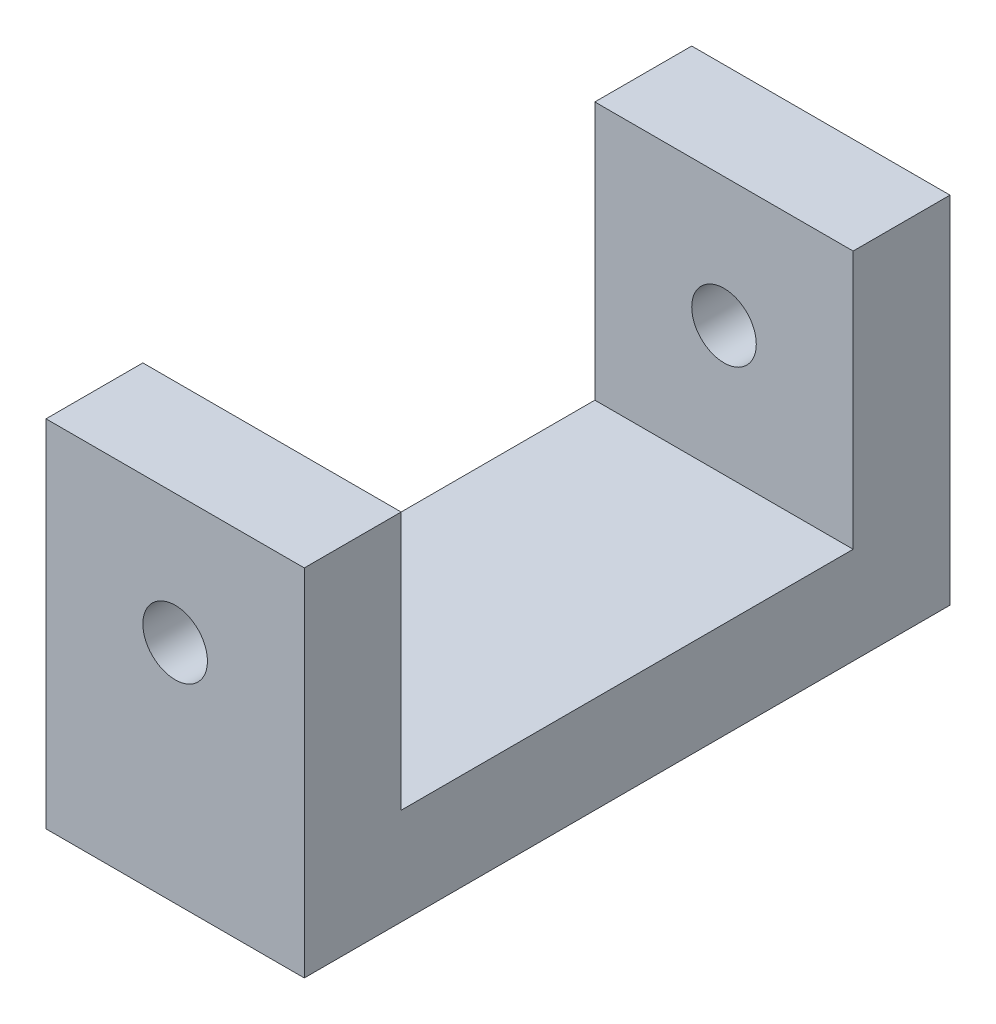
ISO-10303-21;
HEADER;
FILE_DESCRIPTION(('STEP AP214'),'2;1');
FILE_NAME('part.step','',(''),(''),'','','');
FILE_SCHEMA(('AUTOMOTIVE_DESIGN { 1 0 10303 214 1 1 1 1 }'));
ENDSEC;
DATA;
#1=APPLICATION_CONTEXT('core data for automotive mechanical design processes');
#2=APPLICATION_PROTOCOL_DEFINITION('international standard','automotive_design',2000,#1);
#3=PRODUCT_CONTEXT('',#1,'mechanical');
#4=PRODUCT('Part','Part','',(#3));
#5=PRODUCT_RELATED_PRODUCT_CATEGORY('part','',(#4));
#6=PRODUCT_DEFINITION_FORMATION('','',#4);
#7=PRODUCT_DEFINITION_CONTEXT('part definition',#1,'design');
#8=PRODUCT_DEFINITION('design','',#6,#7);
#9=PRODUCT_DEFINITION_SHAPE('','',#8);
#10=(LENGTH_UNIT() NAMED_UNIT(*) SI_UNIT(.MILLI.,.METRE.));
#11=(NAMED_UNIT(*) PLANE_ANGLE_UNIT() SI_UNIT($,.RADIAN.));
#12=(NAMED_UNIT(*) SI_UNIT($,.STERADIAN.) SOLID_ANGLE_UNIT());
#13=UNCERTAINTY_MEASURE_WITH_UNIT(LENGTH_MEASURE(1.E-05),#10,'distance_accuracy_value','');
#14=(GEOMETRIC_REPRESENTATION_CONTEXT(3) GLOBAL_UNCERTAINTY_ASSIGNED_CONTEXT((#13)) GLOBAL_UNIT_ASSIGNED_CONTEXT((#10,
#11,#12)) REPRESENTATION_CONTEXT('',''));
#15=CARTESIAN_POINT('',(0.,0.,0.));
#16=DIRECTION('',(0.,0.,1.));
#17=DIRECTION('',(1.,0.,0.));
#18=AXIS2_PLACEMENT_3D('',#15,#16,#17);
#19=CARTESIAN_POINT('',(0.,0.,-100.));
#20=DIRECTION('',(-1.,0.,0.));
#21=DIRECTION('',(0.,0.,1.));
#22=AXIS2_PLACEMENT_3D('',#19,#20,#21);
#23=PLANE('',#22);
#24=DIRECTION('',(0.,0.,1.));
#25=VECTOR('',#24,1.);
#26=CARTESIAN_POINT('',(0.,15.,-85.));
#27=LINE('',#26,#25);
#28=CARTESIAN_POINT('',(0.,15.,-85.));
#29=VERTEX_POINT('',#28);
#30=CARTESIAN_POINT('',(0.,15.,-15.));
#31=VERTEX_POINT('',#30);
#32=EDGE_CURVE('E102',#29,#31,#27,.T.);
#33=ORIENTED_EDGE('',*,*,#32,.F.);
#34=DIRECTION('',(0.,1.,0.));
#35=VECTOR('',#34,1.);
#36=CARTESIAN_POINT('',(0.,15.,-85.));
#37=LINE('',#36,#35);
#38=CARTESIAN_POINT('',(0.,55.,-85.));
#39=VERTEX_POINT('',#38);
#40=EDGE_CURVE('E50',#29,#39,#37,.T.);
#41=ORIENTED_EDGE('',*,*,#40,.T.);
#42=DIRECTION('',(0.,0.,1.));
#43=VECTOR('',#42,1.);
#44=CARTESIAN_POINT('',(0.,55.,-100.));
#45=LINE('',#44,#43);
#46=CARTESIAN_POINT('',(0.,55.,-100.));
#47=VERTEX_POINT('',#46);
#48=EDGE_CURVE('E99',#47,#39,#45,.T.);
#49=ORIENTED_EDGE('',*,*,#48,.F.);
#50=DIRECTION('',(0.,-1.,0.));
#51=VECTOR('',#50,1.);
#52=CARTESIAN_POINT('',(0.,0.,-100.));
#53=LINE('',#52,#51);
#54=CARTESIAN_POINT('',(0.,0.,-100.));
#55=VERTEX_POINT('',#54);
#56=EDGE_CURVE('E151',#47,#55,#53,.T.);
#57=ORIENTED_EDGE('',*,*,#56,.T.);
#58=DIRECTION('',(0.,0.,1.));
#59=VECTOR('',#58,1.);
#60=CARTESIAN_POINT('',(0.,0.,-100.));
#61=LINE('',#60,#59);
#62=CARTESIAN_POINT('',(0.,0.,0.));
#63=VERTEX_POINT('',#62);
#64=EDGE_CURVE('E42',#55,#63,#61,.T.);
#65=ORIENTED_EDGE('',*,*,#64,.T.);
#66=DIRECTION('',(0.,-1.,0.));
#67=VECTOR('',#66,1.);
#68=CARTESIAN_POINT('',(0.,0.,0.));
#69=LINE('',#68,#67);
#70=CARTESIAN_POINT('',(0.,55.,0.));
#71=VERTEX_POINT('',#70);
#72=EDGE_CURVE('E103',#71,#63,#69,.T.);
#73=ORIENTED_EDGE('',*,*,#72,.F.);
#74=DIRECTION('',(0.,0.,1.));
#75=VECTOR('',#74,1.);
#76=CARTESIAN_POINT('',(0.,55.,0.));
#77=LINE('',#76,#75);
#78=CARTESIAN_POINT('',(0.,55.,-15.));
#79=VERTEX_POINT('',#78);
#80=EDGE_CURVE('E126',#79,#71,#77,.T.);
#81=ORIENTED_EDGE('',*,*,#80,.F.);
#82=DIRECTION('',(0.,-1.,0.));
#83=VECTOR('',#82,1.);
#84=CARTESIAN_POINT('',(0.,45.,-15.));
#85=LINE('',#84,#83);
#86=EDGE_CURVE('E104',#79,#31,#85,.T.);
#87=ORIENTED_EDGE('',*,*,#86,.T.);
#88=EDGE_LOOP('',(#33,#41,#49,#57,#65,#73,#81,#87));
#89=FACE_BOUND('',#88,.T.);
#90=ADVANCED_FACE('F34',(#89),#23,.T.);
#91=CARTESIAN_POINT('',(40.,0.,-100.));
#92=DIRECTION('',(1.,0.,0.));
#93=DIRECTION('',(0.,0.,-1.));
#94=AXIS2_PLACEMENT_3D('',#91,#92,#93);
#95=PLANE('',#94);
#96=DIRECTION('',(0.,1.,0.));
#97=VECTOR('',#96,1.);
#98=CARTESIAN_POINT('',(40.,15.,-85.));
#99=LINE('',#98,#97);
#100=CARTESIAN_POINT('',(40.,15.,-85.));
#101=VERTEX_POINT('',#100);
#102=CARTESIAN_POINT('',(40.,55.,-85.));
#103=VERTEX_POINT('',#102);
#104=EDGE_CURVE('E109',#101,#103,#99,.T.);
#105=ORIENTED_EDGE('',*,*,#104,.F.);
#106=DIRECTION('',(0.,0.,-1.));
#107=VECTOR('',#106,1.);
#108=CARTESIAN_POINT('',(40.,15.,-85.));
#109=LINE('',#108,#107);
#110=CARTESIAN_POINT('',(40.,15.,-15.));
#111=VERTEX_POINT('',#110);
#112=EDGE_CURVE('E120',#111,#101,#109,.T.);
#113=ORIENTED_EDGE('',*,*,#112,.F.);
#114=DIRECTION('',(0.,-1.,0.));
#115=VECTOR('',#114,1.);
#116=CARTESIAN_POINT('',(40.,45.,-15.));
#117=LINE('',#116,#115);
#118=CARTESIAN_POINT('',(40.,55.,-15.));
#119=VERTEX_POINT('',#118);
#120=EDGE_CURVE('E147',#119,#111,#117,.T.);
#121=ORIENTED_EDGE('',*,*,#120,.F.);
#122=DIRECTION('',(0.,0.,-1.));
#123=VECTOR('',#122,1.);
#124=CARTESIAN_POINT('',(40.,55.,0.));
#125=LINE('',#124,#123);
#126=CARTESIAN_POINT('',(40.,55.,0.));
#127=VERTEX_POINT('',#126);
#128=EDGE_CURVE('E132',#127,#119,#125,.T.);
#129=ORIENTED_EDGE('',*,*,#128,.F.);
#130=DIRECTION('',(0.,1.,0.));
#131=VECTOR('',#130,1.);
#132=CARTESIAN_POINT('',(40.,0.,0.));
#133=LINE('',#132,#131);
#134=CARTESIAN_POINT('',(40.,0.,0.));
#135=VERTEX_POINT('',#134);
#136=EDGE_CURVE('E154',#135,#127,#133,.T.);
#137=ORIENTED_EDGE('',*,*,#136,.F.);
#138=DIRECTION('',(0.,0.,1.));
#139=VECTOR('',#138,1.);
#140=CARTESIAN_POINT('',(40.,0.,-100.));
#141=LINE('',#140,#139);
#142=CARTESIAN_POINT('',(40.,0.,-100.));
#143=VERTEX_POINT('',#142);
#144=EDGE_CURVE('E11',#143,#135,#141,.T.);
#145=ORIENTED_EDGE('',*,*,#144,.F.);
#146=DIRECTION('',(0.,1.,0.));
#147=VECTOR('',#146,1.);
#148=CARTESIAN_POINT('',(40.,0.,-100.));
#149=LINE('',#148,#147);
#150=CARTESIAN_POINT('',(40.,55.,-100.));
#151=VERTEX_POINT('',#150);
#152=EDGE_CURVE('E157',#143,#151,#149,.T.);
#153=ORIENTED_EDGE('',*,*,#152,.T.);
#154=DIRECTION('',(0.,0.,-1.));
#155=VECTOR('',#154,1.);
#156=CARTESIAN_POINT('',(40.,55.,-100.));
#157=LINE('',#156,#155);
#158=EDGE_CURVE('E113',#103,#151,#157,.T.);
#159=ORIENTED_EDGE('',*,*,#158,.F.);
#160=EDGE_LOOP('',(#105,#113,#121,#129,#137,#145,#153,#159));
#161=FACE_BOUND('',#160,.T.);
#162=ADVANCED_FACE('F187',(#161),#95,.T.);
#163=CARTESIAN_POINT('',(0.,0.,-100.));
#164=DIRECTION('',(0.,-1.,0.));
#165=DIRECTION('',(0.,0.,-1.));
#166=AXIS2_PLACEMENT_3D('',#163,#164,#165);
#167=PLANE('',#166);
#168=DIRECTION('',(1.,0.,0.));
#169=VECTOR('',#168,1.);
#170=CARTESIAN_POINT('',(0.,0.,0.));
#171=LINE('',#170,#169);
#172=EDGE_CURVE('E161',#63,#135,#171,.T.);
#173=ORIENTED_EDGE('',*,*,#172,.F.);
#174=ORIENTED_EDGE('',*,*,#64,.F.);
#175=DIRECTION('',(1.,0.,0.));
#176=VECTOR('',#175,1.);
#177=CARTESIAN_POINT('',(0.,0.,-100.));
#178=LINE('',#177,#176);
#179=EDGE_CURVE('E153',#55,#143,#178,.T.);
#180=ORIENTED_EDGE('',*,*,#179,.T.);
#181=ORIENTED_EDGE('',*,*,#144,.T.);
#182=EDGE_LOOP('',(#173,#174,#180,#181));
#183=FACE_BOUND('',#182,.T.);
#184=ADVANCED_FACE('F169',(#183),#167,.T.);
#185=CARTESIAN_POINT('',(0.,0.,-100.));
#186=DIRECTION('',(0.,0.,-1.));
#187=DIRECTION('',(-1.,0.,0.));
#188=AXIS2_PLACEMENT_3D('',#185,#186,#187);
#189=PLANE('',#188);
#190=CARTESIAN_POINT('',(20.,35.,-100.));
#191=DIRECTION('',(0.,0.,1.));
#192=DIRECTION('',(1.,0.,0.));
#193=AXIS2_PLACEMENT_3D('',#190,#191,#192);
#194=CIRCLE('',#193,5.);
#195=CARTESIAN_POINT('',(25.,35.,-100.));
#196=VERTEX_POINT('',#195);
#197=EDGE_CURVE('E139',#196,#196,#194,.T.);
#198=ORIENTED_EDGE('',*,*,#197,.T.);
#199=EDGE_LOOP('',(#198));
#200=FACE_BOUND('',#199,.T.);
#201=ORIENTED_EDGE('',*,*,#56,.F.);
#202=DIRECTION('',(-1.,0.,0.));
#203=VECTOR('',#202,1.);
#204=CARTESIAN_POINT('',(0.,55.,-100.));
#205=LINE('',#204,#203);
#206=EDGE_CURVE('E118',#151,#47,#205,.T.);
#207=ORIENTED_EDGE('',*,*,#206,.F.);
#208=ORIENTED_EDGE('',*,*,#152,.F.);
#209=ORIENTED_EDGE('',*,*,#179,.F.);
#210=EDGE_LOOP('',(#201,#207,#208,#209));
#211=FACE_BOUND('',#210,.T.);
#212=ADVANCED_FACE('F190',(#200,#211),#189,.T.);
#213=CARTESIAN_POINT('',(0.,0.,0.));
#214=DIRECTION('',(0.,0.,-1.));
#215=DIRECTION('',(-1.,0.,0.));
#216=AXIS2_PLACEMENT_3D('',#213,#214,#215);
#217=PLANE('',#216);
#218=CARTESIAN_POINT('',(20.,35.,0.));
#219=DIRECTION('',(0.,0.,1.));
#220=DIRECTION('',(1.,0.,0.));
#221=AXIS2_PLACEMENT_3D('',#218,#219,#220);
#222=CIRCLE('',#221,5.);
#223=CARTESIAN_POINT('',(25.,35.,0.));
#224=VERTEX_POINT('',#223);
#225=EDGE_CURVE('E138',#224,#224,#222,.T.);
#226=ORIENTED_EDGE('',*,*,#225,.F.);
#227=EDGE_LOOP('',(#226));
#228=FACE_BOUND('',#227,.T.);
#229=ORIENTED_EDGE('',*,*,#72,.T.);
#230=ORIENTED_EDGE('',*,*,#172,.T.);
#231=ORIENTED_EDGE('',*,*,#136,.T.);
#232=DIRECTION('',(1.,0.,0.));
#233=VECTOR('',#232,1.);
#234=CARTESIAN_POINT('',(0.,55.,0.));
#235=LINE('',#234,#233);
#236=EDGE_CURVE('E129',#71,#127,#235,.T.);
#237=ORIENTED_EDGE('',*,*,#236,.F.);
#238=EDGE_LOOP('',(#229,#230,#231,#237));
#239=FACE_BOUND('',#238,.T.);
#240=ADVANCED_FACE('F172',(#228,#239),#217,.F.);
#241=CARTESIAN_POINT('',(0.,15.,-85.));
#242=DIRECTION('',(0.,0.,-1.));
#243=DIRECTION('',(-1.,0.,0.));
#244=AXIS2_PLACEMENT_3D('',#241,#242,#243);
#245=PLANE('',#244);
#246=CARTESIAN_POINT('',(20.,35.,-85.));
#247=DIRECTION('',(0.,0.,-1.));
#248=DIRECTION('',(-1.,0.,0.));
#249=AXIS2_PLACEMENT_3D('',#246,#247,#248);
#250=CIRCLE('',#249,5.);
#251=CARTESIAN_POINT('',(15.,35.,-85.));
#252=VERTEX_POINT('',#251);
#253=EDGE_CURVE('E144',#252,#252,#250,.T.);
#254=ORIENTED_EDGE('',*,*,#253,.T.);
#255=EDGE_LOOP('',(#254));
#256=FACE_BOUND('',#255,.T.);
#257=ORIENTED_EDGE('',*,*,#40,.F.);
#258=DIRECTION('',(-1.,0.,0.));
#259=VECTOR('',#258,1.);
#260=CARTESIAN_POINT('',(0.,15.,-85.));
#261=LINE('',#260,#259);
#262=EDGE_CURVE('E54',#101,#29,#261,.T.);
#263=ORIENTED_EDGE('',*,*,#262,.F.);
#264=ORIENTED_EDGE('',*,*,#104,.T.);
#265=DIRECTION('',(1.,0.,0.));
#266=VECTOR('',#265,1.);
#267=CARTESIAN_POINT('',(0.,55.,-85.));
#268=LINE('',#267,#266);
#269=EDGE_CURVE('E107',#39,#103,#268,.T.);
#270=ORIENTED_EDGE('',*,*,#269,.F.);
#271=EDGE_LOOP('',(#257,#263,#264,#270));
#272=FACE_BOUND('',#271,.T.);
#273=ADVANCED_FACE('F108',(#256,#272),#245,.F.);
#274=CARTESIAN_POINT('',(0.,45.,-15.));
#275=DIRECTION('',(0.,0.,1.));
#276=DIRECTION('',(0.,-1.,0.));
#277=AXIS2_PLACEMENT_3D('',#274,#275,#276);
#278=PLANE('',#277);
#279=CARTESIAN_POINT('',(20.,35.,-15.));
#280=DIRECTION('',(0.,0.,1.));
#281=DIRECTION('',(0.,-1.,0.));
#282=AXIS2_PLACEMENT_3D('',#279,#280,#281);
#283=CIRCLE('',#282,5.);
#284=CARTESIAN_POINT('',(20.,30.,-15.));
#285=VERTEX_POINT('',#284);
#286=EDGE_CURVE('E37',#285,#285,#283,.T.);
#287=ORIENTED_EDGE('',*,*,#286,.T.);
#288=EDGE_LOOP('',(#287));
#289=FACE_BOUND('',#288,.T.);
#290=ORIENTED_EDGE('',*,*,#120,.T.);
#291=DIRECTION('',(1.,0.,0.));
#292=VECTOR('',#291,1.);
#293=CARTESIAN_POINT('',(0.,15.,-15.));
#294=LINE('',#293,#292);
#295=EDGE_CURVE('E182',#31,#111,#294,.T.);
#296=ORIENTED_EDGE('',*,*,#295,.F.);
#297=ORIENTED_EDGE('',*,*,#86,.F.);
#298=DIRECTION('',(-1.,0.,0.));
#299=VECTOR('',#298,1.);
#300=CARTESIAN_POINT('',(0.,55.,-15.));
#301=LINE('',#300,#299);
#302=EDGE_CURVE('E135',#119,#79,#301,.T.);
#303=ORIENTED_EDGE('',*,*,#302,.F.);
#304=EDGE_LOOP('',(#290,#296,#297,#303));
#305=FACE_BOUND('',#304,.T.);
#306=ADVANCED_FACE('F226',(#289,#305),#278,.F.);
#307=CARTESIAN_POINT('',(20.,35.,-100.));
#308=DIRECTION('',(0.,0.,1.));
#309=DIRECTION('',(1.,0.,0.));
#310=AXIS2_PLACEMENT_3D('',#307,#308,#309);
#311=CYLINDRICAL_SURFACE('',#310,5.);
#312=ORIENTED_EDGE('',*,*,#225,.T.);
#313=EDGE_LOOP('',(#312));
#314=FACE_BOUND('',#313,.T.);
#315=ORIENTED_EDGE('',*,*,#286,.F.);
#316=EDGE_LOOP('',(#315));
#317=FACE_BOUND('',#316,.T.);
#318=ADVANCED_FACE('F220',(#314,#317),#311,.F.);
#319=ORIENTED_EDGE('',*,*,#197,.F.);
#320=EDGE_LOOP('',(#319));
#321=FACE_BOUND('',#320,.T.);
#322=ORIENTED_EDGE('',*,*,#253,.F.);
#323=EDGE_LOOP('',(#322));
#324=FACE_BOUND('',#323,.T.);
#325=ADVANCED_FACE('F225',(#321,#324),#311,.F.);
#326=CARTESIAN_POINT('',(0.,55.,0.));
#327=DIRECTION('',(0.,-1.,0.));
#328=DIRECTION('',(0.,0.,-1.));
#329=AXIS2_PLACEMENT_3D('',#326,#327,#328);
#330=PLANE('',#329);
#331=ORIENTED_EDGE('',*,*,#80,.T.);
#332=ORIENTED_EDGE('',*,*,#236,.T.);
#333=ORIENTED_EDGE('',*,*,#128,.T.);
#334=ORIENTED_EDGE('',*,*,#302,.T.);
#335=EDGE_LOOP('',(#331,#332,#333,#334));
#336=FACE_BOUND('',#335,.T.);
#337=ADVANCED_FACE('F175',(#336),#330,.F.);
#338=CARTESIAN_POINT('',(0.,55.,0.));
#339=DIRECTION('',(0.,1.,0.));
#340=DIRECTION('',(0.,0.,1.));
#341=AXIS2_PLACEMENT_3D('',#338,#339,#340);
#342=PLANE('',#341);
#343=ORIENTED_EDGE('',*,*,#48,.T.);
#344=ORIENTED_EDGE('',*,*,#269,.T.);
#345=ORIENTED_EDGE('',*,*,#158,.T.);
#346=ORIENTED_EDGE('',*,*,#206,.T.);
#347=EDGE_LOOP('',(#343,#344,#345,#346));
#348=FACE_BOUND('',#347,.T.);
#349=ADVANCED_FACE('F116',(#348),#342,.T.);
#350=CARTESIAN_POINT('',(0.,15.,0.));
#351=DIRECTION('',(0.,1.,0.));
#352=DIRECTION('',(0.,0.,1.));
#353=AXIS2_PLACEMENT_3D('',#350,#351,#352);
#354=PLANE('',#353);
#355=ORIENTED_EDGE('',*,*,#32,.T.);
#356=ORIENTED_EDGE('',*,*,#295,.T.);
#357=ORIENTED_EDGE('',*,*,#112,.T.);
#358=ORIENTED_EDGE('',*,*,#262,.T.);
#359=EDGE_LOOP('',(#355,#356,#357,#358));
#360=FACE_BOUND('',#359,.T.);
#361=ADVANCED_FACE('F180',(#360),#354,.T.);
#362=CLOSED_SHELL('',(#90,#162,#184,#212,#240,#273,#306,#318,#325,#337,#349,#361));
#363=MANIFOLD_SOLID_BREP('B2',#362);
#364=ADVANCED_BREP_SHAPE_REPRESENTATION('',(#18,#363),#14);
#365=SHAPE_DEFINITION_REPRESENTATION(#9,#364);
ENDSEC;
END-ISO-10303-21;
